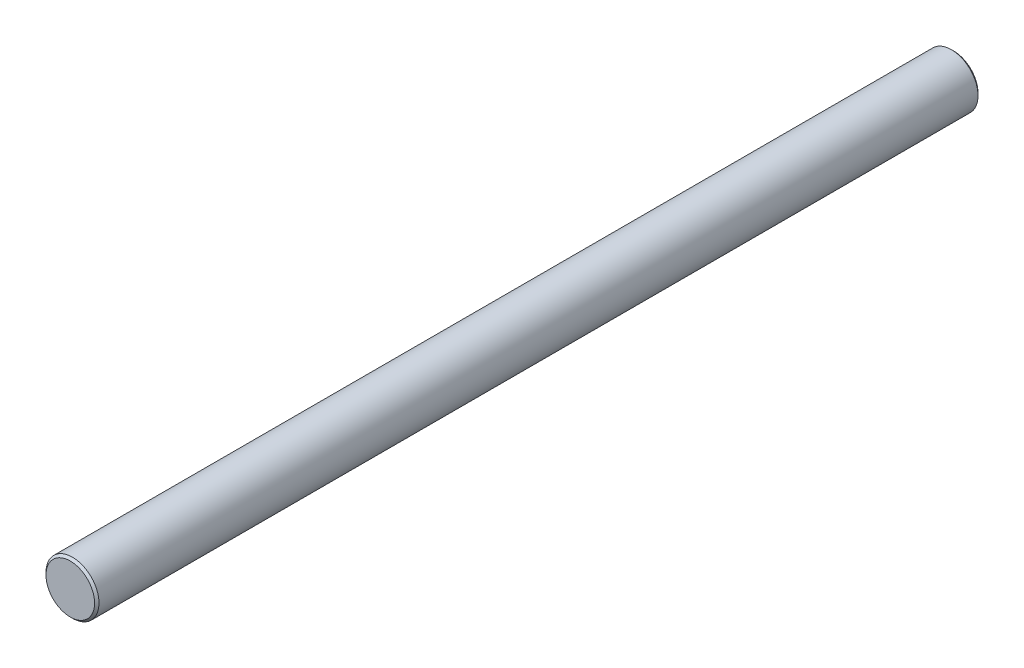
from build123d import *

# Parameters (mm, degrees)
SKETCH_1_R      = 3
EXTRUDE_1_DEPTH = 100
CHAMFER_1_SIZE  = 0.25


with BuildPart() as part:
    # Sketch 1 → Extrude 1 (new body)
    with BuildSketch(Plane.XY):
        with Locations(Location((0, 0, 0), (0, 0, 180))):
            Circle(SKETCH_1_R)
    extrude(amount=EXTRUDE_1_DEPTH)

    # Chamfer 1
    chamfer_1_edges = [part.edges().sort_by_distance(p)[0] for p in [
        (3, 0, 0),
        (3, 0, 100),
    ]]
    chamfer(chamfer_1_edges, length=CHAMFER_1_SIZE)


solid = part.part
